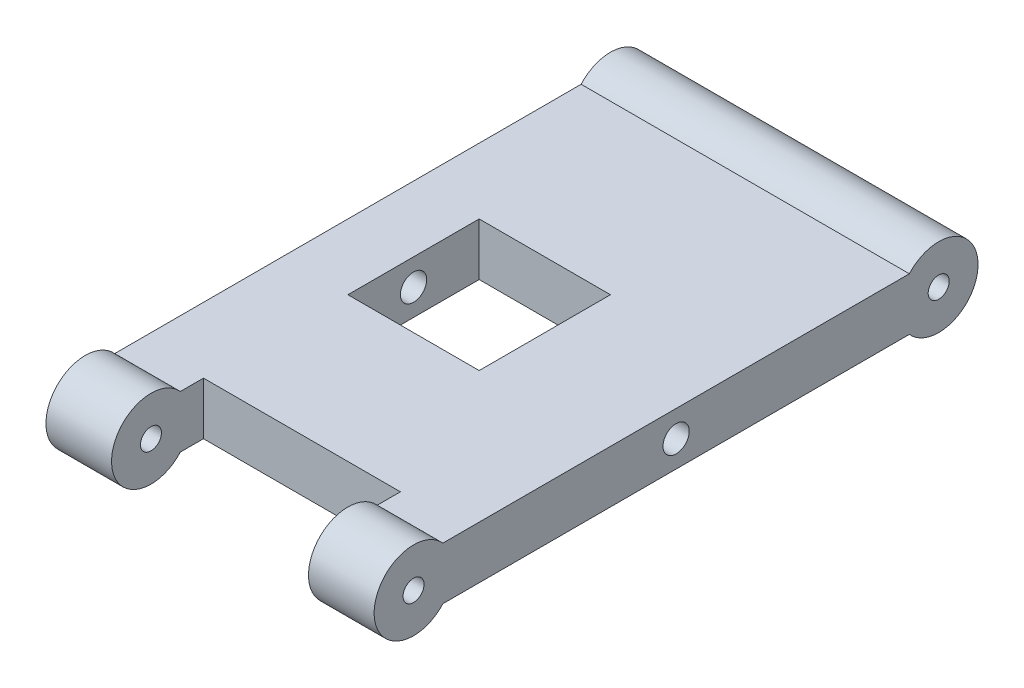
ISO-10303-21;
HEADER;
FILE_DESCRIPTION(('STEP AP214'),'2;1');
FILE_NAME('part.step','',(''),(''),'','','');
FILE_SCHEMA(('AUTOMOTIVE_DESIGN { 1 0 10303 214 1 1 1 1 }'));
ENDSEC;
DATA;
#1=APPLICATION_CONTEXT('core data for automotive mechanical design processes');
#2=APPLICATION_PROTOCOL_DEFINITION('international standard','automotive_design',2000,#1);
#3=PRODUCT_CONTEXT('',#1,'mechanical');
#4=PRODUCT('Part','Part','',(#3));
#5=PRODUCT_RELATED_PRODUCT_CATEGORY('part','',(#4));
#6=PRODUCT_DEFINITION_FORMATION('','',#4);
#7=PRODUCT_DEFINITION_CONTEXT('part definition',#1,'design');
#8=PRODUCT_DEFINITION('design','',#6,#7);
#9=PRODUCT_DEFINITION_SHAPE('','',#8);
#10=(LENGTH_UNIT() NAMED_UNIT(*) SI_UNIT(.MILLI.,.METRE.));
#11=(NAMED_UNIT(*) PLANE_ANGLE_UNIT() SI_UNIT($,.RADIAN.));
#12=(NAMED_UNIT(*) SI_UNIT($,.STERADIAN.) SOLID_ANGLE_UNIT());
#13=UNCERTAINTY_MEASURE_WITH_UNIT(LENGTH_MEASURE(1.E-05),#10,'distance_accuracy_value','');
#14=(GEOMETRIC_REPRESENTATION_CONTEXT(3) GLOBAL_UNCERTAINTY_ASSIGNED_CONTEXT((#13)) GLOBAL_UNIT_ASSIGNED_CONTEXT((#10,
#11,#12)) REPRESENTATION_CONTEXT('',''));
#15=CARTESIAN_POINT('',(0.,0.,0.));
#16=DIRECTION('',(0.,0.,1.));
#17=DIRECTION('',(1.,0.,0.));
#18=AXIS2_PLACEMENT_3D('',#15,#16,#17);
#19=CARTESIAN_POINT('',(0.,2.54,0.));
#20=DIRECTION('',(1.,0.,0.));
#21=DIRECTION('',(0.,0.,-1.));
#22=AXIS2_PLACEMENT_3D('',#19,#20,#21);
#23=CYLINDRICAL_SURFACE('',#22,3.81);
#24=CARTESIAN_POINT('',(6.35,2.54,0.));
#25=DIRECTION('',(-1.,0.,0.));
#26=DIRECTION('',(0.,0.,1.));
#27=AXIS2_PLACEMENT_3D('',#24,#25,#26);
#28=CIRCLE('',#27,3.81);
#29=CARTESIAN_POINT('',(6.35,5.08,-2.83980633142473));
#30=VERTEX_POINT('',#29);
#31=CARTESIAN_POINT('',(6.35,0.,-2.83980633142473));
#32=VERTEX_POINT('',#31);
#33=EDGE_CURVE('E41',#30,#32,#28,.F.);
#34=ORIENTED_EDGE('',*,*,#33,.F.);
#35=DIRECTION('',(1.,0.,0.));
#36=VECTOR('',#35,1.);
#37=CARTESIAN_POINT('',(0.,5.08,-2.83980633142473));
#38=LINE('',#37,#36);
#39=CARTESIAN_POINT('',(0.,5.08,-2.83980633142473));
#40=VERTEX_POINT('',#39);
#41=EDGE_CURVE('E198',#40,#30,#38,.T.);
#42=ORIENTED_EDGE('',*,*,#41,.F.);
#43=CARTESIAN_POINT('',(0.,2.54,0.));
#44=DIRECTION('',(1.,0.,0.));
#45=DIRECTION('',(0.,0.,-1.));
#46=AXIS2_PLACEMENT_3D('',#43,#44,#45);
#47=CIRCLE('',#46,3.81);
#48=CARTESIAN_POINT('',(0.,0.,-2.83980633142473));
#49=VERTEX_POINT('',#48);
#50=EDGE_CURVE('E192',#40,#49,#47,.T.);
#51=ORIENTED_EDGE('',*,*,#50,.T.);
#52=DIRECTION('',(1.,0.,0.));
#53=VECTOR('',#52,1.);
#54=CARTESIAN_POINT('',(0.,0.,-2.83980633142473));
#55=LINE('',#54,#53);
#56=EDGE_CURVE('E201',#32,#49,#55,.F.);
#57=ORIENTED_EDGE('',*,*,#56,.F.);
#58=EDGE_LOOP('',(#34,#42,#51,#57));
#59=FACE_BOUND('',#58,.T.);
#60=ADVANCED_FACE('F32',(#59),#23,.T.);
#61=CARTESIAN_POINT('',(31.75,0.,0.));
#62=DIRECTION('',(0.,1.,0.));
#63=DIRECTION('',(0.,0.,1.));
#64=AXIS2_PLACEMENT_3D('',#61,#62,#63);
#65=PLANE('',#64);
#66=DIRECTION('',(0.,0.,1.));
#67=VECTOR('',#66,1.);
#68=CARTESIAN_POINT('',(6.35,0.,0.));
#69=LINE('',#68,#67);
#70=CARTESIAN_POINT('',(6.35,0.,-31.75));
#71=VERTEX_POINT('',#70);
#72=CARTESIAN_POINT('',(6.35,0.,-19.05));
#73=VERTEX_POINT('',#72);
#74=EDGE_CURVE('E154',#71,#73,#69,.T.);
#75=ORIENTED_EDGE('',*,*,#74,.T.);
#76=DIRECTION('',(1.,0.,0.));
#77=VECTOR('',#76,1.);
#78=CARTESIAN_POINT('',(31.75,0.,-19.05));
#79=LINE('',#78,#77);
#80=CARTESIAN_POINT('',(19.05,0.,-19.05));
#81=VERTEX_POINT('',#80);
#82=EDGE_CURVE('E157',#73,#81,#79,.T.);
#83=ORIENTED_EDGE('',*,*,#82,.T.);
#84=DIRECTION('',(0.,0.,1.));
#85=VECTOR('',#84,1.);
#86=CARTESIAN_POINT('',(19.05,0.,0.));
#87=LINE('',#86,#85);
#88=CARTESIAN_POINT('',(19.05,0.,-31.75));
#89=VERTEX_POINT('',#88);
#90=EDGE_CURVE('E149',#89,#81,#87,.T.);
#91=ORIENTED_EDGE('',*,*,#90,.F.);
#92=DIRECTION('',(1.,0.,0.));
#93=VECTOR('',#92,1.);
#94=CARTESIAN_POINT('',(31.75,0.,-31.75));
#95=LINE('',#94,#93);
#96=EDGE_CURVE('E129',#71,#89,#95,.T.);
#97=ORIENTED_EDGE('',*,*,#96,.F.);
#98=EDGE_LOOP('',(#75,#83,#91,#97));
#99=FACE_BOUND('',#98,.T.);
#100=DIRECTION('',(-1.,0.,0.));
#101=VECTOR('',#100,1.);
#102=CARTESIAN_POINT('',(31.75,0.,-5.08));
#103=LINE('',#102,#101);
#104=CARTESIAN_POINT('',(25.4,0.,-5.08));
#105=VERTEX_POINT('',#104);
#106=CARTESIAN_POINT('',(6.35,0.,-5.08));
#107=VERTEX_POINT('',#106);
#108=EDGE_CURVE('E178',#105,#107,#103,.T.);
#109=ORIENTED_EDGE('',*,*,#108,.T.);
#110=DIRECTION('',(0.,0.,1.));
#111=VECTOR('',#110,1.);
#112=CARTESIAN_POINT('',(6.35,0.,0.));
#113=LINE('',#112,#111);
#114=EDGE_CURVE('E175',#107,#32,#113,.T.);
#115=ORIENTED_EDGE('',*,*,#114,.T.);
#116=ORIENTED_EDGE('',*,*,#56,.T.);
#117=DIRECTION('',(0.,0.,-1.));
#118=VECTOR('',#117,1.);
#119=CARTESIAN_POINT('',(0.,0.,0.));
#120=LINE('',#119,#118);
#121=CARTESIAN_POINT('',(0.,0.,-47.9601936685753));
#122=VERTEX_POINT('',#121);
#123=EDGE_CURVE('E205',#49,#122,#120,.T.);
#124=ORIENTED_EDGE('',*,*,#123,.T.);
#125=DIRECTION('',(1.,0.,0.));
#126=VECTOR('',#125,1.);
#127=CARTESIAN_POINT('',(0.,0.,-47.9601936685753));
#128=LINE('',#127,#126);
#129=CARTESIAN_POINT('',(31.75,0.,-47.9601936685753));
#130=VERTEX_POINT('',#129);
#131=EDGE_CURVE('E188',#122,#130,#128,.T.);
#132=ORIENTED_EDGE('',*,*,#131,.T.);
#133=DIRECTION('',(0.,0.,-1.));
#134=VECTOR('',#133,1.);
#135=CARTESIAN_POINT('',(31.75,0.,0.));
#136=LINE('',#135,#134);
#137=CARTESIAN_POINT('',(31.75,0.,-2.83980633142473));
#138=VERTEX_POINT('',#137);
#139=EDGE_CURVE('E206',#138,#130,#136,.T.);
#140=ORIENTED_EDGE('',*,*,#139,.F.);
#141=CARTESIAN_POINT('',(25.4,0.,-2.83980633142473));
#142=VERTEX_POINT('',#141);
#143=EDGE_CURVE('E202',#138,#142,#55,.F.);
#144=ORIENTED_EDGE('',*,*,#143,.T.);
#145=DIRECTION('',(0.,0.,-1.));
#146=VECTOR('',#145,1.);
#147=CARTESIAN_POINT('',(25.4,0.,0.));
#148=LINE('',#147,#146);
#149=EDGE_CURVE('E169',#142,#105,#148,.T.);
#150=ORIENTED_EDGE('',*,*,#149,.T.);
#151=EDGE_LOOP('',(#109,#115,#116,#124,#132,#140,#144,#150));
#152=FACE_BOUND('',#151,.T.);
#153=ADVANCED_FACE('F34',(#99,#152),#65,.F.);
#154=CARTESIAN_POINT('',(31.75,5.08,0.));
#155=DIRECTION('',(0.,-1.,0.));
#156=DIRECTION('',(0.,0.,-1.));
#157=AXIS2_PLACEMENT_3D('',#154,#155,#156);
#158=PLANE('',#157);
#159=DIRECTION('',(0.,0.,1.));
#160=VECTOR('',#159,1.);
#161=CARTESIAN_POINT('',(19.05,5.08,-31.75));
#162=LINE('',#161,#160);
#163=CARTESIAN_POINT('',(19.05,5.08,-31.75));
#164=VERTEX_POINT('',#163);
#165=CARTESIAN_POINT('',(19.05,5.08,-19.05));
#166=VERTEX_POINT('',#165);
#167=EDGE_CURVE('E135',#164,#166,#162,.T.);
#168=ORIENTED_EDGE('',*,*,#167,.T.);
#169=DIRECTION('',(1.,0.,0.));
#170=VECTOR('',#169,1.);
#171=CARTESIAN_POINT('',(6.35,5.08,-19.05));
#172=LINE('',#171,#170);
#173=CARTESIAN_POINT('',(6.35,5.08,-19.05));
#174=VERTEX_POINT('',#173);
#175=EDGE_CURVE('E57',#174,#166,#172,.T.);
#176=ORIENTED_EDGE('',*,*,#175,.F.);
#177=DIRECTION('',(0.,0.,1.));
#178=VECTOR('',#177,1.);
#179=CARTESIAN_POINT('',(6.35,5.08,-31.75));
#180=LINE('',#179,#178);
#181=CARTESIAN_POINT('',(6.35,5.08,-31.75));
#182=VERTEX_POINT('',#181);
#183=EDGE_CURVE('E142',#182,#174,#180,.T.);
#184=ORIENTED_EDGE('',*,*,#183,.F.);
#185=DIRECTION('',(1.,0.,0.));
#186=VECTOR('',#185,1.);
#187=CARTESIAN_POINT('',(6.35,5.08,-31.75));
#188=LINE('',#187,#186);
#189=EDGE_CURVE('E126',#182,#164,#188,.T.);
#190=ORIENTED_EDGE('',*,*,#189,.T.);
#191=EDGE_LOOP('',(#168,#176,#184,#190));
#192=FACE_BOUND('',#191,.T.);
#193=ORIENTED_EDGE('',*,*,#41,.T.);
#194=DIRECTION('',(0.,0.,-1.));
#195=VECTOR('',#194,1.);
#196=CARTESIAN_POINT('',(6.35,5.08,0.));
#197=LINE('',#196,#195);
#198=CARTESIAN_POINT('',(6.35,5.08,-5.08));
#199=VERTEX_POINT('',#198);
#200=EDGE_CURVE('E172',#30,#199,#197,.T.);
#201=ORIENTED_EDGE('',*,*,#200,.T.);
#202=DIRECTION('',(1.,0.,0.));
#203=VECTOR('',#202,1.);
#204=CARTESIAN_POINT('',(31.75,5.08,-5.08));
#205=LINE('',#204,#203);
#206=CARTESIAN_POINT('',(25.4,5.08,-5.08));
#207=VERTEX_POINT('',#206);
#208=EDGE_CURVE('E11',#199,#207,#205,.T.);
#209=ORIENTED_EDGE('',*,*,#208,.T.);
#210=DIRECTION('',(0.,0.,1.));
#211=VECTOR('',#210,1.);
#212=CARTESIAN_POINT('',(25.4,5.08,0.));
#213=LINE('',#212,#211);
#214=CARTESIAN_POINT('',(25.4,5.08,-2.83980633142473));
#215=VERTEX_POINT('',#214);
#216=EDGE_CURVE('E164',#207,#215,#213,.T.);
#217=ORIENTED_EDGE('',*,*,#216,.T.);
#218=CARTESIAN_POINT('',(31.75,5.08,-2.83980633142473));
#219=VERTEX_POINT('',#218);
#220=EDGE_CURVE('E195',#215,#219,#38,.T.);
#221=ORIENTED_EDGE('',*,*,#220,.T.);
#222=DIRECTION('',(0.,0.,1.));
#223=VECTOR('',#222,1.);
#224=CARTESIAN_POINT('',(31.75,5.08,0.));
#225=LINE('',#224,#223);
#226=CARTESIAN_POINT('',(31.75,5.08,-47.9601936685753));
#227=VERTEX_POINT('',#226);
#228=EDGE_CURVE('E209',#227,#219,#225,.T.);
#229=ORIENTED_EDGE('',*,*,#228,.F.);
#230=DIRECTION('',(1.,0.,0.));
#231=VECTOR('',#230,1.);
#232=CARTESIAN_POINT('',(0.,5.08,-47.9601936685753));
#233=LINE('',#232,#231);
#234=CARTESIAN_POINT('',(0.,5.08,-47.9601936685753));
#235=VERTEX_POINT('',#234);
#236=EDGE_CURVE('E184',#227,#235,#233,.F.);
#237=ORIENTED_EDGE('',*,*,#236,.T.);
#238=DIRECTION('',(0.,0.,1.));
#239=VECTOR('',#238,1.);
#240=CARTESIAN_POINT('',(0.,5.08,0.));
#241=LINE('',#240,#239);
#242=EDGE_CURVE('E210',#235,#40,#241,.T.);
#243=ORIENTED_EDGE('',*,*,#242,.T.);
#244=EDGE_LOOP('',(#193,#201,#209,#217,#221,#229,#237,#243));
#245=FACE_BOUND('',#244,.T.);
#246=ADVANCED_FACE('F139',(#192,#245),#158,.F.);
#247=CARTESIAN_POINT('',(31.75,0.,0.));
#248=DIRECTION('',(-1.,0.,0.));
#249=DIRECTION('',(0.,0.,1.));
#250=AXIS2_PLACEMENT_3D('',#247,#248,#249);
#251=PLANE('',#250);
#252=CARTESIAN_POINT('',(31.75,2.54,-50.8));
#253=DIRECTION('',(-1.,0.,0.));
#254=DIRECTION('',(0.,0.,1.));
#255=AXIS2_PLACEMENT_3D('',#252,#253,#254);
#256=CIRCLE('',#255,1.016);
#257=CARTESIAN_POINT('',(31.75,2.54,-49.784));
#258=VERTEX_POINT('',#257);
#259=EDGE_CURVE('E246',#258,#258,#256,.T.);
#260=ORIENTED_EDGE('',*,*,#259,.T.);
#261=EDGE_LOOP('',(#260));
#262=FACE_BOUND('',#261,.T.);
#263=CARTESIAN_POINT('',(31.75,2.54,0.));
#264=DIRECTION('',(-1.,0.,0.));
#265=DIRECTION('',(0.,0.,1.));
#266=AXIS2_PLACEMENT_3D('',#263,#264,#265);
#267=CIRCLE('',#266,1.016);
#268=CARTESIAN_POINT('',(31.75,2.54,1.016));
#269=VERTEX_POINT('',#268);
#270=EDGE_CURVE('E240',#269,#269,#267,.T.);
#271=ORIENTED_EDGE('',*,*,#270,.T.);
#272=EDGE_LOOP('',(#271));
#273=FACE_BOUND('',#272,.T.);
#274=CARTESIAN_POINT('',(31.75,2.54,-25.4));
#275=DIRECTION('',(-1.,0.,0.));
#276=DIRECTION('',(0.,0.,1.));
#277=AXIS2_PLACEMENT_3D('',#274,#275,#276);
#278=CIRCLE('',#277,1.27);
#279=CARTESIAN_POINT('',(31.75,2.54,-24.13));
#280=VERTEX_POINT('',#279);
#281=EDGE_CURVE('E221',#280,#280,#278,.T.);
#282=ORIENTED_EDGE('',*,*,#281,.T.);
#283=EDGE_LOOP('',(#282));
#284=FACE_BOUND('',#283,.T.);
#285=ORIENTED_EDGE('',*,*,#139,.T.);
#286=CARTESIAN_POINT('',(31.75,2.54,-50.8));
#287=DIRECTION('',(1.,0.,0.));
#288=DIRECTION('',(0.,0.,-1.));
#289=AXIS2_PLACEMENT_3D('',#286,#287,#288);
#290=CIRCLE('',#289,3.81);
#291=EDGE_CURVE('E181',#130,#227,#290,.T.);
#292=ORIENTED_EDGE('',*,*,#291,.T.);
#293=ORIENTED_EDGE('',*,*,#228,.T.);
#294=CARTESIAN_POINT('',(31.75,2.54,0.));
#295=DIRECTION('',(1.,0.,0.));
#296=DIRECTION('',(0.,0.,-1.));
#297=AXIS2_PLACEMENT_3D('',#294,#295,#296);
#298=CIRCLE('',#297,3.81);
#299=EDGE_CURVE('E191',#219,#138,#298,.T.);
#300=ORIENTED_EDGE('',*,*,#299,.T.);
#301=EDGE_LOOP('',(#285,#292,#293,#300));
#302=FACE_BOUND('',#301,.T.);
#303=ADVANCED_FACE('F296',(#262,#273,#284,#302),#251,.F.);
#304=CARTESIAN_POINT('',(0.,0.,0.));
#305=DIRECTION('',(-1.,0.,0.));
#306=DIRECTION('',(0.,0.,1.));
#307=AXIS2_PLACEMENT_3D('',#304,#305,#306);
#308=PLANE('',#307);
#309=CARTESIAN_POINT('',(0.,2.54,-50.8));
#310=DIRECTION('',(-1.,0.,0.));
#311=DIRECTION('',(0.,0.,1.));
#312=AXIS2_PLACEMENT_3D('',#309,#310,#311);
#313=CIRCLE('',#312,1.016);
#314=CARTESIAN_POINT('',(0.,2.54,-49.784));
#315=VERTEX_POINT('',#314);
#316=EDGE_CURVE('E243',#315,#315,#313,.T.);
#317=ORIENTED_EDGE('',*,*,#316,.F.);
#318=EDGE_LOOP('',(#317));
#319=FACE_BOUND('',#318,.T.);
#320=CARTESIAN_POINT('',(0.,2.54,0.));
#321=DIRECTION('',(-1.,0.,0.));
#322=DIRECTION('',(0.,0.,1.));
#323=AXIS2_PLACEMENT_3D('',#320,#321,#322);
#324=CIRCLE('',#323,1.016);
#325=CARTESIAN_POINT('',(0.,2.54,1.016));
#326=VERTEX_POINT('',#325);
#327=EDGE_CURVE('E237',#326,#326,#324,.T.);
#328=ORIENTED_EDGE('',*,*,#327,.F.);
#329=EDGE_LOOP('',(#328));
#330=FACE_BOUND('',#329,.T.);
#331=CARTESIAN_POINT('',(0.,2.54,-25.4));
#332=DIRECTION('',(-1.,0.,0.));
#333=DIRECTION('',(0.,0.,1.));
#334=AXIS2_PLACEMENT_3D('',#331,#332,#333);
#335=CIRCLE('',#334,1.27);
#336=CARTESIAN_POINT('',(0.,2.54,-24.13));
#337=VERTEX_POINT('',#336);
#338=EDGE_CURVE('E227',#337,#337,#335,.T.);
#339=ORIENTED_EDGE('',*,*,#338,.F.);
#340=EDGE_LOOP('',(#339));
#341=FACE_BOUND('',#340,.T.);
#342=ORIENTED_EDGE('',*,*,#242,.F.);
#343=CARTESIAN_POINT('',(0.,2.54,-50.8));
#344=DIRECTION('',(1.,0.,0.));
#345=DIRECTION('',(0.,0.,-1.));
#346=AXIS2_PLACEMENT_3D('',#343,#344,#345);
#347=CIRCLE('',#346,3.81);
#348=EDGE_CURVE('E182',#122,#235,#347,.T.);
#349=ORIENTED_EDGE('',*,*,#348,.F.);
#350=ORIENTED_EDGE('',*,*,#123,.F.);
#351=ORIENTED_EDGE('',*,*,#50,.F.);
#352=EDGE_LOOP('',(#342,#349,#350,#351));
#353=FACE_BOUND('',#352,.T.);
#354=ADVANCED_FACE('F287',(#319,#330,#341,#353),#308,.T.);
#355=CARTESIAN_POINT('',(25.4,2.54,0.));
#356=DIRECTION('',(1.,0.,0.));
#357=DIRECTION('',(0.,0.,-1.));
#358=AXIS2_PLACEMENT_3D('',#355,#356,#357);
#359=CIRCLE('',#358,3.81);
#360=EDGE_CURVE('E213',#142,#215,#359,.F.);
#361=ORIENTED_EDGE('',*,*,#360,.F.);
#362=ORIENTED_EDGE('',*,*,#143,.F.);
#363=ORIENTED_EDGE('',*,*,#299,.F.);
#364=ORIENTED_EDGE('',*,*,#220,.F.);
#365=EDGE_LOOP('',(#361,#362,#363,#364));
#366=FACE_BOUND('',#365,.T.);
#367=ADVANCED_FACE('F276',(#366),#23,.T.);
#368=CARTESIAN_POINT('',(0.,2.54,-50.8));
#369=DIRECTION('',(1.,0.,0.));
#370=DIRECTION('',(0.,0.,-1.));
#371=AXIS2_PLACEMENT_3D('',#368,#369,#370);
#372=CYLINDRICAL_SURFACE('',#371,3.81);
#373=ORIENTED_EDGE('',*,*,#131,.F.);
#374=ORIENTED_EDGE('',*,*,#348,.T.);
#375=ORIENTED_EDGE('',*,*,#236,.F.);
#376=ORIENTED_EDGE('',*,*,#291,.F.);
#377=EDGE_LOOP('',(#373,#374,#375,#376));
#378=FACE_BOUND('',#377,.T.);
#379=ADVANCED_FACE('F286',(#378),#372,.T.);
#380=CARTESIAN_POINT('',(6.35,-10.795,-5.08));
#381=DIRECTION('',(0.,0.,-1.));
#382=DIRECTION('',(-1.,0.,0.));
#383=AXIS2_PLACEMENT_3D('',#380,#381,#382);
#384=PLANE('',#383);
#385=DIRECTION('',(0.,1.,0.));
#386=VECTOR('',#385,1.);
#387=CARTESIAN_POINT('',(25.4,-10.795,-5.08));
#388=LINE('',#387,#386);
#389=EDGE_CURVE('E160',#105,#207,#388,.T.);
#390=ORIENTED_EDGE('',*,*,#389,.T.);
#391=ORIENTED_EDGE('',*,*,#208,.F.);
#392=DIRECTION('',(0.,1.,0.));
#393=VECTOR('',#392,1.);
#394=CARTESIAN_POINT('',(6.35,-10.795,-5.08));
#395=LINE('',#394,#393);
#396=EDGE_CURVE('E161',#107,#199,#395,.T.);
#397=ORIENTED_EDGE('',*,*,#396,.F.);
#398=ORIENTED_EDGE('',*,*,#108,.F.);
#399=EDGE_LOOP('',(#390,#391,#397,#398));
#400=FACE_BOUND('',#399,.T.);
#401=ADVANCED_FACE('F293',(#400),#384,.F.);
#402=CARTESIAN_POINT('',(6.35,-10.795,-5.08));
#403=DIRECTION('',(-1.,0.,0.));
#404=DIRECTION('',(0.,0.,1.));
#405=AXIS2_PLACEMENT_3D('',#402,#403,#404);
#406=PLANE('',#405);
#407=CARTESIAN_POINT('',(6.35,2.54,0.));
#408=DIRECTION('',(-1.,0.,0.));
#409=DIRECTION('',(0.,0.,1.));
#410=AXIS2_PLACEMENT_3D('',#407,#408,#409);
#411=CIRCLE('',#410,1.016);
#412=CARTESIAN_POINT('',(6.35,2.54,1.016));
#413=VERTEX_POINT('',#412);
#414=EDGE_CURVE('E232',#413,#413,#411,.T.);
#415=ORIENTED_EDGE('',*,*,#414,.T.);
#416=EDGE_LOOP('',(#415));
#417=FACE_BOUND('',#416,.T.);
#418=ORIENTED_EDGE('',*,*,#396,.T.);
#419=ORIENTED_EDGE('',*,*,#200,.F.);
#420=ORIENTED_EDGE('',*,*,#33,.T.);
#421=ORIENTED_EDGE('',*,*,#114,.F.);
#422=EDGE_LOOP('',(#418,#419,#420,#421));
#423=FACE_BOUND('',#422,.T.);
#424=ADVANCED_FACE('F318',(#417,#423),#406,.F.);
#425=CARTESIAN_POINT('',(25.4,-10.795,-5.08));
#426=DIRECTION('',(1.,0.,0.));
#427=DIRECTION('',(0.,0.,-1.));
#428=AXIS2_PLACEMENT_3D('',#425,#426,#427);
#429=PLANE('',#428);
#430=CARTESIAN_POINT('',(25.4,2.54,0.));
#431=DIRECTION('',(1.,0.,0.));
#432=DIRECTION('',(0.,0.,-1.));
#433=AXIS2_PLACEMENT_3D('',#430,#431,#432);
#434=CIRCLE('',#433,1.016);
#435=CARTESIAN_POINT('',(25.4,2.54,-1.016));
#436=VERTEX_POINT('',#435);
#437=EDGE_CURVE('E36',#436,#436,#434,.T.);
#438=ORIENTED_EDGE('',*,*,#437,.T.);
#439=EDGE_LOOP('',(#438));
#440=FACE_BOUND('',#439,.T.);
#441=ORIENTED_EDGE('',*,*,#360,.T.);
#442=ORIENTED_EDGE('',*,*,#216,.F.);
#443=ORIENTED_EDGE('',*,*,#389,.F.);
#444=ORIENTED_EDGE('',*,*,#149,.F.);
#445=EDGE_LOOP('',(#441,#442,#443,#444));
#446=FACE_BOUND('',#445,.T.);
#447=ADVANCED_FACE('F253',(#440,#446),#429,.F.);
#448=CARTESIAN_POINT('',(6.35,-1.27,-19.05));
#449=DIRECTION('',(0.,0.,1.));
#450=DIRECTION('',(1.,0.,0.));
#451=AXIS2_PLACEMENT_3D('',#448,#449,#450);
#452=PLANE('',#451);
#453=DIRECTION('',(0.,1.,0.));
#454=VECTOR('',#453,1.);
#455=CARTESIAN_POINT('',(6.35,-1.27,-19.05));
#456=LINE('',#455,#454);
#457=EDGE_CURVE('E147',#73,#174,#456,.T.);
#458=ORIENTED_EDGE('',*,*,#457,.T.);
#459=ORIENTED_EDGE('',*,*,#175,.T.);
#460=DIRECTION('',(0.,1.,0.));
#461=VECTOR('',#460,1.);
#462=CARTESIAN_POINT('',(19.05,-1.27,-19.05));
#463=LINE('',#462,#461);
#464=EDGE_CURVE('E132',#81,#166,#463,.T.);
#465=ORIENTED_EDGE('',*,*,#464,.F.);
#466=ORIENTED_EDGE('',*,*,#82,.F.);
#467=EDGE_LOOP('',(#458,#459,#465,#466));
#468=FACE_BOUND('',#467,.T.);
#469=ADVANCED_FACE('F325',(#468),#452,.F.);
#470=CARTESIAN_POINT('',(6.35,-1.27,-31.75));
#471=DIRECTION('',(-1.,0.,0.));
#472=DIRECTION('',(0.,0.,1.));
#473=AXIS2_PLACEMENT_3D('',#470,#471,#472);
#474=PLANE('',#473);
#475=CARTESIAN_POINT('',(6.35,2.54,-25.4));
#476=DIRECTION('',(-1.,0.,0.));
#477=DIRECTION('',(0.,0.,1.));
#478=AXIS2_PLACEMENT_3D('',#475,#476,#477);
#479=CIRCLE('',#478,1.27);
#480=CARTESIAN_POINT('',(6.35,2.54,-24.13));
#481=VERTEX_POINT('',#480);
#482=EDGE_CURVE('E220',#481,#481,#479,.T.);
#483=ORIENTED_EDGE('',*,*,#482,.T.);
#484=EDGE_LOOP('',(#483));
#485=FACE_BOUND('',#484,.T.);
#486=DIRECTION('',(0.,1.,0.));
#487=VECTOR('',#486,1.);
#488=CARTESIAN_POINT('',(6.35,-1.27,-31.75));
#489=LINE('',#488,#487);
#490=EDGE_CURVE('E131',#71,#182,#489,.T.);
#491=ORIENTED_EDGE('',*,*,#490,.T.);
#492=ORIENTED_EDGE('',*,*,#183,.T.);
#493=ORIENTED_EDGE('',*,*,#457,.F.);
#494=ORIENTED_EDGE('',*,*,#74,.F.);
#495=EDGE_LOOP('',(#491,#492,#493,#494));
#496=FACE_BOUND('',#495,.T.);
#497=ADVANCED_FACE('F332',(#485,#496),#474,.F.);
#498=CARTESIAN_POINT('',(6.35,-1.27,-31.75));
#499=DIRECTION('',(0.,0.,1.));
#500=DIRECTION('',(1.,0.,0.));
#501=AXIS2_PLACEMENT_3D('',#498,#499,#500);
#502=PLANE('',#501);
#503=ORIENTED_EDGE('',*,*,#96,.T.);
#504=DIRECTION('',(0.,1.,0.));
#505=VECTOR('',#504,1.);
#506=CARTESIAN_POINT('',(19.05,-1.27,-31.75));
#507=LINE('',#506,#505);
#508=EDGE_CURVE('E49',#89,#164,#507,.T.);
#509=ORIENTED_EDGE('',*,*,#508,.T.);
#510=ORIENTED_EDGE('',*,*,#189,.F.);
#511=ORIENTED_EDGE('',*,*,#490,.F.);
#512=EDGE_LOOP('',(#503,#509,#510,#511));
#513=FACE_BOUND('',#512,.T.);
#514=ADVANCED_FACE('F123',(#513),#502,.T.);
#515=CARTESIAN_POINT('',(19.05,-1.27,-31.75));
#516=DIRECTION('',(-1.,0.,0.));
#517=DIRECTION('',(0.,0.,1.));
#518=AXIS2_PLACEMENT_3D('',#515,#516,#517);
#519=PLANE('',#518);
#520=CARTESIAN_POINT('',(19.05,2.54,-25.4));
#521=DIRECTION('',(-1.,0.,0.));
#522=DIRECTION('',(0.,0.,1.));
#523=AXIS2_PLACEMENT_3D('',#520,#521,#522);
#524=CIRCLE('',#523,1.27);
#525=CARTESIAN_POINT('',(19.05,2.54,-24.13));
#526=VERTEX_POINT('',#525);
#527=EDGE_CURVE('E218',#526,#526,#524,.T.);
#528=ORIENTED_EDGE('',*,*,#527,.F.);
#529=EDGE_LOOP('',(#528));
#530=FACE_BOUND('',#529,.T.);
#531=ORIENTED_EDGE('',*,*,#90,.T.);
#532=ORIENTED_EDGE('',*,*,#464,.T.);
#533=ORIENTED_EDGE('',*,*,#167,.F.);
#534=ORIENTED_EDGE('',*,*,#508,.F.);
#535=EDGE_LOOP('',(#531,#532,#533,#534));
#536=FACE_BOUND('',#535,.T.);
#537=ADVANCED_FACE('F136',(#530,#536),#519,.T.);
#538=CARTESIAN_POINT('',(31.75,2.54,-25.4));
#539=DIRECTION('',(-1.,0.,0.));
#540=DIRECTION('',(0.,0.,1.));
#541=AXIS2_PLACEMENT_3D('',#538,#539,#540);
#542=CYLINDRICAL_SURFACE('',#541,1.27);
#543=ORIENTED_EDGE('',*,*,#527,.T.);
#544=EDGE_LOOP('',(#543));
#545=FACE_BOUND('',#544,.T.);
#546=ORIENTED_EDGE('',*,*,#281,.F.);
#547=EDGE_LOOP('',(#546));
#548=FACE_BOUND('',#547,.T.);
#549=ADVANCED_FACE('F268',(#545,#548),#542,.F.);
#550=ORIENTED_EDGE('',*,*,#338,.T.);
#551=EDGE_LOOP('',(#550));
#552=FACE_BOUND('',#551,.T.);
#553=ORIENTED_EDGE('',*,*,#482,.F.);
#554=EDGE_LOOP('',(#553));
#555=FACE_BOUND('',#554,.T.);
#556=ADVANCED_FACE('F259',(#552,#555),#542,.F.);
#557=CARTESIAN_POINT('',(31.75,2.54,0.));
#558=DIRECTION('',(-1.,0.,0.));
#559=DIRECTION('',(0.,0.,1.));
#560=AXIS2_PLACEMENT_3D('',#557,#558,#559);
#561=CYLINDRICAL_SURFACE('',#560,1.016);
#562=ORIENTED_EDGE('',*,*,#270,.F.);
#563=EDGE_LOOP('',(#562));
#564=FACE_BOUND('',#563,.T.);
#565=ORIENTED_EDGE('',*,*,#437,.F.);
#566=EDGE_LOOP('',(#565));
#567=FACE_BOUND('',#566,.T.);
#568=ADVANCED_FACE('F256',(#564,#567),#561,.F.);
#569=ORIENTED_EDGE('',*,*,#327,.T.);
#570=EDGE_LOOP('',(#569));
#571=FACE_BOUND('',#570,.T.);
#572=ORIENTED_EDGE('',*,*,#414,.F.);
#573=EDGE_LOOP('',(#572));
#574=FACE_BOUND('',#573,.T.);
#575=ADVANCED_FACE('F258',(#571,#574),#561,.F.);
#576=CARTESIAN_POINT('',(31.75,2.54,-50.8));
#577=DIRECTION('',(-1.,0.,0.));
#578=DIRECTION('',(0.,0.,1.));
#579=AXIS2_PLACEMENT_3D('',#576,#577,#578);
#580=CYLINDRICAL_SURFACE('',#579,1.016);
#581=ORIENTED_EDGE('',*,*,#259,.F.);
#582=EDGE_LOOP('',(#581));
#583=FACE_BOUND('',#582,.T.);
#584=ORIENTED_EDGE('',*,*,#316,.T.);
#585=EDGE_LOOP('',(#584));
#586=FACE_BOUND('',#585,.T.);
#587=ADVANCED_FACE('F266',(#583,#586),#580,.F.);
#588=CLOSED_SHELL('',(#60,#153,#246,#303,#354,#367,#379,#401,#424,#447,#469,#497,#514,#537,#549,
#556,#568,#575,#587));
#589=MANIFOLD_SOLID_BREP('B2',#588);
#590=ADVANCED_BREP_SHAPE_REPRESENTATION('',(#18,#589),#14);
#591=SHAPE_DEFINITION_REPRESENTATION(#9,#590);
ENDSEC;
END-ISO-10303-21;
